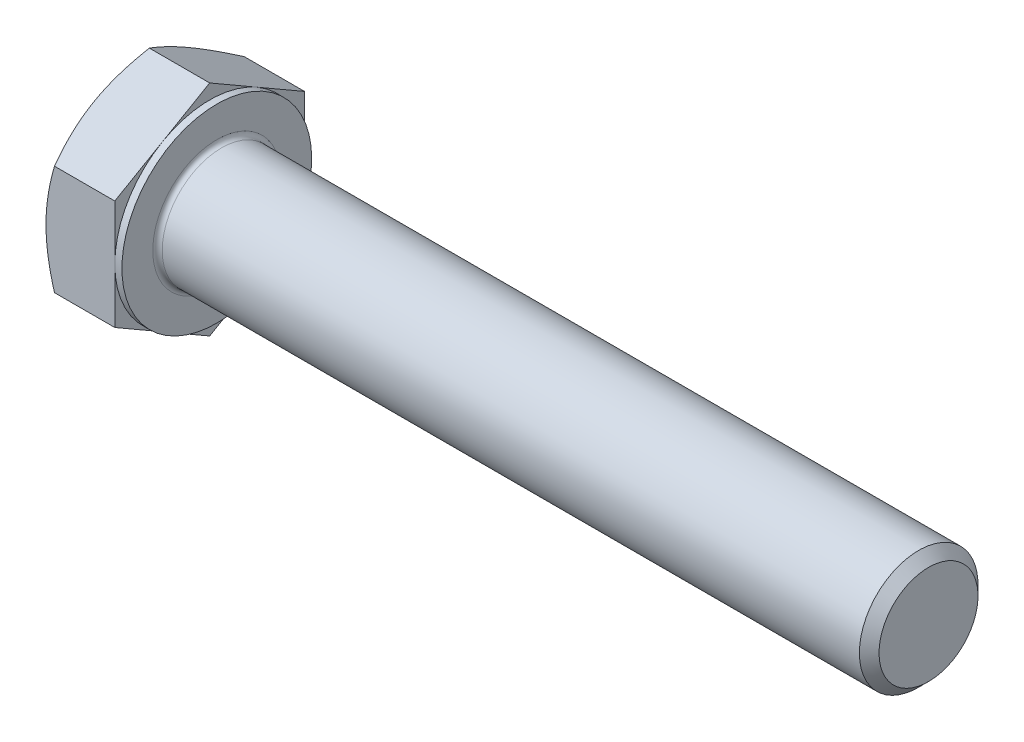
from build123d import *

# Parameters (mm, degrees)
BASEHEAD_DEPTH = 6.4
HEADFILLET_R   = 0.4
SKETCH4_W      = 0.6
SKETCH4_H      = 11.237604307


with BuildPart() as part:
    # Sketch1 → BaseHead (new body)
    with BuildSketch(Plane(origin=(0, 0, 0), x_dir=(0, 0, -1), z_dir=(1, 0, 0))):
        Polygon((8, 4.618802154), (8, -4.618802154), (0, -9.237604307), (-8, -4.618802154), (-8, 4.618802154), (0, 9.237604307), align=None)
    extrude(amount=BASEHEAD_DEPTH)

    # BodySke → BaseBody (revolve)
    with BuildSketch(Plane.XY, mode=Mode.PRIVATE) as basebody_sk:
        Polygon((0, 0), (66.4, 0), (66.4, 4.172), (65.572, 5), (0, 5), align=None)
    revolve(basebody_sk.sketch.rotate(Axis((0, 0, 0), (1, 0, 0)), 90), axis=Axis((0, 0, 0), (1, 0, 0)))

    # HeadFillet
    headfillet_edges = [part.edges().sort_by_distance(p)[0] for p in [
        (6.4, 0, -5),
    ]]
    fillet(headfillet_edges, radius=HEADFILLET_R)

    # Sketch3 → HeadChamfer (revolve, cut)
    with BuildSketch(Plane.XY, mode=Mode.PRIVATE) as headchamfer_sk:
        Polygon((0, 8), (3.601282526, 14.237604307), (3.601282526, 19.237604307), (-10, 19.237604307), (-10, 8), align=None)
    revolve(headchamfer_sk.sketch.rotate(Axis((0, 0, 0), (1, 0, 0)), 270), axis=Axis((0, 0, 0), (1, 0, 0)), mode=Mode.SUBTRACT)

    # Sketch4 → BearingFace (revolve, cut)
    with BuildSketch(Plane.XY, mode=Mode.PRIVATE) as bearingface_sk:
        with Locations((6.1, 13.618802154)):
            Rectangle(SKETCH4_W, SKETCH4_H)
    revolve(bearingface_sk.sketch.rotate(Axis((0, 0, 0), (1, 0, 0)), 270), axis=Axis((0, 0, 0), (1, 0, 0)), mode=Mode.SUBTRACT)


solid = part.part
